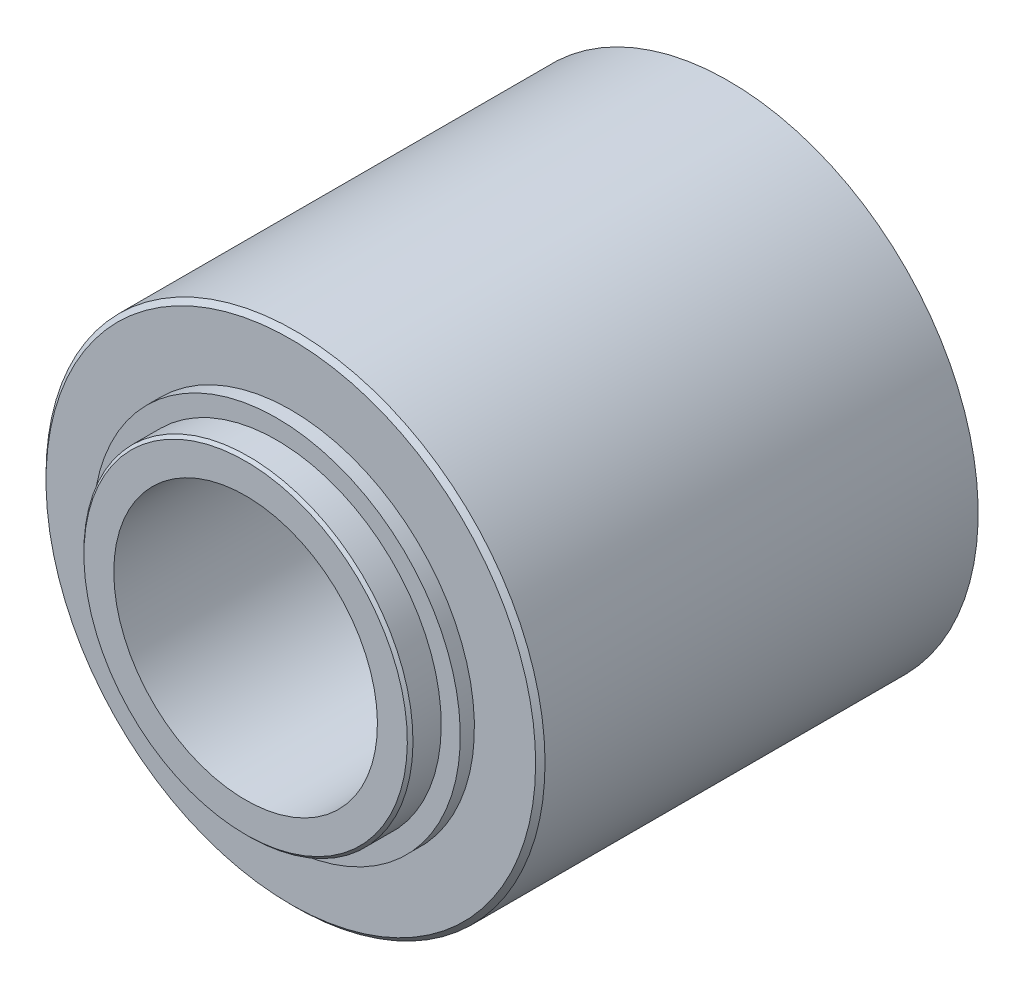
ISO-10303-21;
HEADER;
FILE_DESCRIPTION(('STEP AP214'),'2;1');
FILE_NAME('part.step','',(''),(''),'','','');
FILE_SCHEMA(('AUTOMOTIVE_DESIGN { 1 0 10303 214 1 1 1 1 }'));
ENDSEC;
DATA;
#1=APPLICATION_CONTEXT('core data for automotive mechanical design processes');
#2=APPLICATION_PROTOCOL_DEFINITION('international standard','automotive_design',2000,#1);
#3=PRODUCT_CONTEXT('',#1,'mechanical');
#4=PRODUCT('Part','Part','',(#3));
#5=PRODUCT_RELATED_PRODUCT_CATEGORY('part','',(#4));
#6=PRODUCT_DEFINITION_FORMATION('','',#4);
#7=PRODUCT_DEFINITION_CONTEXT('part definition',#1,'design');
#8=PRODUCT_DEFINITION('design','',#6,#7);
#9=PRODUCT_DEFINITION_SHAPE('','',#8);
#10=(LENGTH_UNIT() NAMED_UNIT(*) SI_UNIT(.MILLI.,.METRE.));
#11=(NAMED_UNIT(*) PLANE_ANGLE_UNIT() SI_UNIT($,.RADIAN.));
#12=(NAMED_UNIT(*) SI_UNIT($,.STERADIAN.) SOLID_ANGLE_UNIT());
#13=UNCERTAINTY_MEASURE_WITH_UNIT(LENGTH_MEASURE(1.E-05),#10,'distance_accuracy_value','');
#14=(GEOMETRIC_REPRESENTATION_CONTEXT(3) GLOBAL_UNCERTAINTY_ASSIGNED_CONTEXT((#13)) GLOBAL_UNIT_ASSIGNED_CONTEXT((#10,
#11,#12)) REPRESENTATION_CONTEXT('',''));
#15=CARTESIAN_POINT('',(0.,0.,0.));
#16=DIRECTION('',(0.,0.,1.));
#17=DIRECTION('',(1.,0.,0.));
#18=AXIS2_PLACEMENT_3D('',#15,#16,#17);
#19=CARTESIAN_POINT('',(0.,0.,46.5));
#20=DIRECTION('',(0.,0.,-1.));
#21=DIRECTION('',(-0.707106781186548,0.707106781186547,0.));
#22=AXIS2_PLACEMENT_3D('',#19,#20,#21);
#23=CONICAL_SURFACE('',#22,26.,0.785398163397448);
#24=CARTESIAN_POINT('',(0.,0.,46.5));
#25=DIRECTION('',(0.,0.,-1.));
#26=DIRECTION('',(-0.707106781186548,0.707106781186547,0.));
#27=AXIS2_PLACEMENT_3D('',#24,#25,#26);
#28=CIRCLE('',#27,26.);
#29=CARTESIAN_POINT('',(-18.3847763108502,18.3847763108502,46.5));
#30=VERTEX_POINT('',#29);
#31=EDGE_CURVE('E8',#30,#30,#28,.T.);
#32=ORIENTED_EDGE('',*,*,#31,.T.);
#33=EDGE_LOOP('',(#32));
#34=FACE_BOUND('',#33,.T.);
#35=CARTESIAN_POINT('',(0.,0.,46.));
#36=DIRECTION('',(0.,0.,-1.));
#37=DIRECTION('',(-1.,0.,0.));
#38=AXIS2_PLACEMENT_3D('',#35,#36,#37);
#39=CIRCLE('',#38,26.5);
#40=CARTESIAN_POINT('',(-26.5,0.,46.));
#41=VERTEX_POINT('',#40);
#42=EDGE_CURVE('E76',#41,#41,#39,.T.);
#43=ORIENTED_EDGE('',*,*,#42,.F.);
#44=EDGE_LOOP('',(#43));
#45=FACE_BOUND('',#44,.T.);
#46=ADVANCED_FACE('F12',(#34,#45),#23,.T.);
#47=CARTESIAN_POINT('',(-19.0918830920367,-19.0918830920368,0.));
#48=DIRECTION('',(0.,0.,1.));
#49=DIRECTION('',(0.707106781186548,-0.707106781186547,0.));
#50=AXIS2_PLACEMENT_3D('',#47,#48,#49);
#51=PLANE('',#50);
#52=CARTESIAN_POINT('',(0.,0.,0.));
#53=DIRECTION('',(0.,0.,-1.));
#54=DIRECTION('',(-0.707106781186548,0.707106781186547,0.));
#55=AXIS2_PLACEMENT_3D('',#52,#53,#54);
#56=CIRCLE('',#55,14.);
#57=CARTESIAN_POINT('',(-9.89949493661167,9.89949493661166,0.));
#58=VERTEX_POINT('',#57);
#59=EDGE_CURVE('E37',#58,#58,#56,.T.);
#60=ORIENTED_EDGE('',*,*,#59,.F.);
#61=EDGE_LOOP('',(#60));
#62=FACE_BOUND('',#61,.T.);
#63=CARTESIAN_POINT('',(-23.000259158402,-0.000447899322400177,0.));
#64=DIRECTION('',(0.,0.,-1.));
#65=DIRECTION('',(-0.707106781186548,0.707106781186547,0.));
#66=AXIS2_PLACEMENT_3D('',#63,#64,#65);
#67=CIRCLE('',#66,3.);
#68=CARTESIAN_POINT('',(-25.1215795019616,2.12087244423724,0.));
#69=VERTEX_POINT('',#68);
#70=EDGE_CURVE('E43',#69,#69,#67,.T.);
#71=ORIENTED_EDGE('',*,*,#70,.F.);
#72=EDGE_LOOP('',(#71));
#73=FACE_BOUND('',#72,.T.);
#74=CARTESIAN_POINT('',(11.499740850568,-19.919032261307,0.));
#75=DIRECTION('',(0.,0.,-1.));
#76=DIRECTION('',(-0.707106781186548,0.707106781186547,0.));
#77=AXIS2_PLACEMENT_3D('',#74,#75,#76);
#78=CIRCLE('',#77,3.);
#79=CARTESIAN_POINT('',(9.37842050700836,-17.7977119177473,0.));
#80=VERTEX_POINT('',#79);
#81=EDGE_CURVE('E49',#80,#80,#78,.T.);
#82=ORIENTED_EDGE('',*,*,#81,.F.);
#83=EDGE_LOOP('',(#82));
#84=FACE_BOUND('',#83,.T.);
#85=CARTESIAN_POINT('',(-11.5002591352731,-19.9190322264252,0.));
#86=DIRECTION('',(0.,0.,-1.));
#87=DIRECTION('',(-0.707106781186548,0.707106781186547,0.));
#88=AXIS2_PLACEMENT_3D('',#85,#86,#87);
#89=CIRCLE('',#88,3.);
#90=CARTESIAN_POINT('',(-13.6215794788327,-17.7977118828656,0.));
#91=VERTEX_POINT('',#90);
#92=EDGE_CURVE('E55',#91,#91,#89,.T.);
#93=ORIENTED_EDGE('',*,*,#92,.F.);
#94=EDGE_LOOP('',(#93));
#95=FACE_BOUND('',#94,.T.);
#96=CARTESIAN_POINT('',(-11.5002591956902,19.9181363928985,0.));
#97=DIRECTION('',(0.,0.,-1.));
#98=DIRECTION('',(-0.707106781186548,0.707106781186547,0.));
#99=AXIS2_PLACEMENT_3D('',#96,#97,#98);
#100=CIRCLE('',#99,3.);
#101=CARTESIAN_POINT('',(-13.6215795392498,22.0394567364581,0.));
#102=VERTEX_POINT('',#101);
#103=EDGE_CURVE('E61',#102,#102,#100,.T.);
#104=ORIENTED_EDGE('',*,*,#103,.F.);
#105=EDGE_LOOP('',(#104));
#106=FACE_BOUND('',#105,.T.);
#107=CARTESIAN_POINT('',(11.4997407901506,19.9181363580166,0.));
#108=DIRECTION('',(0.,0.,-1.));
#109=DIRECTION('',(-0.707106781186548,0.707106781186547,0.));
#110=AXIS2_PLACEMENT_3D('',#107,#108,#109);
#111=CIRCLE('',#110,3.);
#112=CARTESIAN_POINT('',(9.37842044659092,22.0394567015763,0.));
#113=VERTEX_POINT('',#112);
#114=EDGE_CURVE('E67',#113,#113,#111,.T.);
#115=ORIENTED_EDGE('',*,*,#114,.F.);
#116=EDGE_LOOP('',(#115));
#117=FACE_BOUND('',#116,.T.);
#118=CARTESIAN_POINT('',(22.9997408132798,-0.000447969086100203,0.));
#119=DIRECTION('',(0.,0.,-1.));
#120=DIRECTION('',(-0.707106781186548,0.707106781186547,0.));
#121=AXIS2_PLACEMENT_3D('',#118,#119,#120);
#122=CIRCLE('',#121,3.);
#123=CARTESIAN_POINT('',(20.8784204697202,2.12087237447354,0.));
#124=VERTEX_POINT('',#123);
#125=EDGE_CURVE('E73',#124,#124,#122,.T.);
#126=ORIENTED_EDGE('',*,*,#125,.F.);
#127=EDGE_LOOP('',(#126));
#128=FACE_BOUND('',#127,.T.);
#129=CARTESIAN_POINT('',(0.,0.,0.));
#130=DIRECTION('',(0.,0.,-1.));
#131=DIRECTION('',(-1.,0.,0.));
#132=AXIS2_PLACEMENT_3D('',#129,#130,#131);
#133=CIRCLE('',#132,26.5);
#134=CARTESIAN_POINT('',(-26.5,0.,0.));
#135=VERTEX_POINT('',#134);
#136=EDGE_CURVE('E79',#135,#135,#133,.T.);
#137=ORIENTED_EDGE('',*,*,#136,.T.);
#138=EDGE_LOOP('',(#137));
#139=FACE_BOUND('',#138,.T.);
#140=ADVANCED_FACE('F107',(#62,#73,#84,#95,#106,#117,#128,#139),#51,.F.);
#141=CARTESIAN_POINT('',(-18.3847763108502,-18.3847763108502,46.5));
#142=DIRECTION('',(0.,0.,-1.));
#143=DIRECTION('',(-0.707106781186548,0.707106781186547,0.));
#144=AXIS2_PLACEMENT_3D('',#141,#142,#143);
#145=PLANE('',#144);
#146=ORIENTED_EDGE('',*,*,#31,.F.);
#147=EDGE_LOOP('',(#146));
#148=FACE_BOUND('',#147,.T.);
#149=CARTESIAN_POINT('',(0.,0.,46.5));
#150=DIRECTION('',(0.,0.,-1.));
#151=DIRECTION('',(-0.707106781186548,0.707106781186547,0.));
#152=AXIS2_PLACEMENT_3D('',#149,#150,#151);
#153=CIRCLE('',#152,19.5);
#154=CARTESIAN_POINT('',(-13.7885822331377,13.7885822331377,46.5));
#155=VERTEX_POINT('',#154);
#156=EDGE_CURVE('E18',#155,#155,#153,.T.);
#157=ORIENTED_EDGE('',*,*,#156,.T.);
#158=EDGE_LOOP('',(#157));
#159=FACE_BOUND('',#158,.T.);
#160=ADVANCED_FACE('F112',(#148,#159),#145,.F.);
#161=CARTESIAN_POINT('',(0.,0.,-5.));
#162=DIRECTION('',(0.,0.,-1.));
#163=DIRECTION('',(-0.707106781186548,0.707106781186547,0.));
#164=AXIS2_PLACEMENT_3D('',#161,#162,#163);
#165=CYLINDRICAL_SURFACE('',#164,19.5);
#166=ORIENTED_EDGE('',*,*,#156,.F.);
#167=EDGE_LOOP('',(#166));
#168=FACE_BOUND('',#167,.T.);
#169=CARTESIAN_POINT('',(0.,0.,48.));
#170=DIRECTION('',(0.,0.,-1.));
#171=DIRECTION('',(-0.707106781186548,0.707106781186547,0.));
#172=AXIS2_PLACEMENT_3D('',#169,#170,#171);
#173=CIRCLE('',#172,19.5);
#174=CARTESIAN_POINT('',(-13.7885822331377,13.7885822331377,48.));
#175=VERTEX_POINT('',#174);
#176=EDGE_CURVE('E22',#175,#175,#173,.T.);
#177=ORIENTED_EDGE('',*,*,#176,.T.);
#178=EDGE_LOOP('',(#177));
#179=FACE_BOUND('',#178,.T.);
#180=ADVANCED_FACE('F313',(#168,#179),#165,.T.);
#181=CARTESIAN_POINT('',(-13.7885822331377,-13.7885822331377,48.));
#182=DIRECTION('',(0.,0.,-1.));
#183=DIRECTION('',(-0.707106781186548,0.707106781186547,0.));
#184=AXIS2_PLACEMENT_3D('',#181,#182,#183);
#185=PLANE('',#184);
#186=ORIENTED_EDGE('',*,*,#176,.F.);
#187=EDGE_LOOP('',(#186));
#188=FACE_BOUND('',#187,.T.);
#189=CARTESIAN_POINT('',(0.,0.,48.));
#190=DIRECTION('',(0.,0.,-1.));
#191=DIRECTION('',(-0.707106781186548,0.707106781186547,0.));
#192=AXIS2_PLACEMENT_3D('',#189,#190,#191);
#193=CIRCLE('',#192,17.475);
#194=CARTESIAN_POINT('',(-12.3566910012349,12.3566910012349,48.));
#195=VERTEX_POINT('',#194);
#196=EDGE_CURVE('E26',#195,#195,#193,.T.);
#197=ORIENTED_EDGE('',*,*,#196,.T.);
#198=EDGE_LOOP('',(#197));
#199=FACE_BOUND('',#198,.T.);
#200=ADVANCED_FACE('F304',(#188,#199),#185,.F.);
#201=CARTESIAN_POINT('',(0.,0.,-5.));
#202=DIRECTION('',(0.,0.,-1.));
#203=DIRECTION('',(-0.707106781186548,0.707106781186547,0.));
#204=AXIS2_PLACEMENT_3D('',#201,#202,#203);
#205=CYLINDRICAL_SURFACE('',#204,17.475);
#206=ORIENTED_EDGE('',*,*,#196,.F.);
#207=EDGE_LOOP('',(#206));
#208=FACE_BOUND('',#207,.T.);
#209=CARTESIAN_POINT('',(0.,0.,51.));
#210=DIRECTION('',(0.,0.,-1.));
#211=DIRECTION('',(-0.707106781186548,0.707106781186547,0.));
#212=AXIS2_PLACEMENT_3D('',#209,#210,#211);
#213=CIRCLE('',#212,17.475);
#214=CARTESIAN_POINT('',(-12.3566910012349,12.3566910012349,51.));
#215=VERTEX_POINT('',#214);
#216=EDGE_CURVE('E31',#215,#215,#213,.T.);
#217=ORIENTED_EDGE('',*,*,#216,.T.);
#218=EDGE_LOOP('',(#217));
#219=FACE_BOUND('',#218,.T.);
#220=ADVANCED_FACE('F296',(#208,#219),#205,.T.);
#221=CARTESIAN_POINT('',(0.,0.,51.3));
#222=DIRECTION('',(0.,0.,-1.));
#223=DIRECTION('',(-0.707106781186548,0.707106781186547,0.));
#224=AXIS2_PLACEMENT_3D('',#221,#222,#223);
#225=CONICAL_SURFACE('',#224,17.175,0.785398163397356);
#226=ORIENTED_EDGE('',*,*,#216,.F.);
#227=EDGE_LOOP('',(#226));
#228=FACE_BOUND('',#227,.T.);
#229=CARTESIAN_POINT('',(0.,0.,51.3));
#230=DIRECTION('',(0.,0.,-1.));
#231=DIRECTION('',(-0.707106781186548,0.707106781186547,0.));
#232=AXIS2_PLACEMENT_3D('',#229,#230,#231);
#233=CIRCLE('',#232,17.175);
#234=CARTESIAN_POINT('',(-12.144558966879,12.1445589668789,51.3));
#235=VERTEX_POINT('',#234);
#236=EDGE_CURVE('E34',#235,#235,#233,.T.);
#237=ORIENTED_EDGE('',*,*,#236,.T.);
#238=EDGE_LOOP('',(#237));
#239=FACE_BOUND('',#238,.T.);
#240=ADVANCED_FACE('F102',(#228,#239),#225,.T.);
#241=CARTESIAN_POINT('',(-12.144558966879,-12.1445589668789,51.3));
#242=DIRECTION('',(0.,0.,-1.));
#243=DIRECTION('',(-0.707106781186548,0.707106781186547,0.));
#244=AXIS2_PLACEMENT_3D('',#241,#242,#243);
#245=PLANE('',#244);
#246=ORIENTED_EDGE('',*,*,#236,.F.);
#247=EDGE_LOOP('',(#246));
#248=FACE_BOUND('',#247,.T.);
#249=CARTESIAN_POINT('',(0.,0.,51.3));
#250=DIRECTION('',(0.,0.,-1.));
#251=DIRECTION('',(-1.,0.,0.));
#252=AXIS2_PLACEMENT_3D('',#249,#250,#251);
#253=CIRCLE('',#252,14.);
#254=CARTESIAN_POINT('',(-14.,0.,51.3));
#255=VERTEX_POINT('',#254);
#256=EDGE_CURVE('E82',#255,#255,#253,.T.);
#257=ORIENTED_EDGE('',*,*,#256,.T.);
#258=EDGE_LOOP('',(#257));
#259=FACE_BOUND('',#258,.T.);
#260=ADVANCED_FACE('F86',(#248,#259),#245,.F.);
#261=CARTESIAN_POINT('',(0.,0.,-5.));
#262=DIRECTION('',(0.,0.,-1.));
#263=DIRECTION('',(-0.707106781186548,0.707106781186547,0.));
#264=AXIS2_PLACEMENT_3D('',#261,#262,#263);
#265=CYLINDRICAL_SURFACE('',#264,14.);
#266=ORIENTED_EDGE('',*,*,#59,.T.);
#267=EDGE_LOOP('',(#266));
#268=FACE_BOUND('',#267,.T.);
#269=ORIENTED_EDGE('',*,*,#256,.F.);
#270=EDGE_LOOP('',(#269));
#271=FACE_BOUND('',#270,.T.);
#272=ADVANCED_FACE('F88',(#268,#271),#265,.F.);
#273=CARTESIAN_POINT('',(-23.000259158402,-0.000447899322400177,9.));
#274=DIRECTION('',(0.,0.,-1.));
#275=DIRECTION('',(-0.707106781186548,0.707106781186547,0.));
#276=AXIS2_PLACEMENT_3D('',#273,#274,#275);
#277=CYLINDRICAL_SURFACE('',#276,3.);
#278=CARTESIAN_POINT('',(-23.000259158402,-0.000447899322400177,9.));
#279=DIRECTION('',(0.,0.,-1.));
#280=DIRECTION('',(-0.707106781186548,0.707106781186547,0.));
#281=AXIS2_PLACEMENT_3D('',#278,#279,#280);
#282=CIRCLE('',#281,3.);
#283=CARTESIAN_POINT('',(-25.1215795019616,2.12087244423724,9.));
#284=VERTEX_POINT('',#283);
#285=EDGE_CURVE('E40',#284,#284,#282,.T.);
#286=ORIENTED_EDGE('',*,*,#285,.F.);
#287=EDGE_LOOP('',(#286));
#288=FACE_BOUND('',#287,.T.);
#289=ORIENTED_EDGE('',*,*,#70,.T.);
#290=EDGE_LOOP('',(#289));
#291=FACE_BOUND('',#290,.T.);
#292=ADVANCED_FACE('F90',(#288,#291),#277,.F.);
#293=CARTESIAN_POINT('',(-23.000259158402,-0.000447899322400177,9.));
#294=DIRECTION('',(0.,0.,-1.));
#295=DIRECTION('',(-0.707106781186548,0.707106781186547,0.));
#296=AXIS2_PLACEMENT_3D('',#293,#294,#295);
#297=PLANE('',#296);
#298=ORIENTED_EDGE('',*,*,#285,.T.);
#299=EDGE_LOOP('',(#298));
#300=FACE_BOUND('',#299,.T.);
#301=ADVANCED_FACE('F99',(#300),#297,.T.);
#302=CARTESIAN_POINT('',(11.499740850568,-19.919032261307,9.));
#303=DIRECTION('',(0.,0.,-1.));
#304=DIRECTION('',(-0.707106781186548,0.707106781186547,0.));
#305=AXIS2_PLACEMENT_3D('',#302,#303,#304);
#306=CYLINDRICAL_SURFACE('',#305,3.);
#307=CARTESIAN_POINT('',(11.499740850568,-19.919032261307,9.));
#308=DIRECTION('',(0.,0.,-1.));
#309=DIRECTION('',(-0.707106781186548,0.707106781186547,0.));
#310=AXIS2_PLACEMENT_3D('',#307,#308,#309);
#311=CIRCLE('',#310,3.);
#312=CARTESIAN_POINT('',(9.37842050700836,-17.7977119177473,9.));
#313=VERTEX_POINT('',#312);
#314=EDGE_CURVE('E46',#313,#313,#311,.T.);
#315=ORIENTED_EDGE('',*,*,#314,.F.);
#316=EDGE_LOOP('',(#315));
#317=FACE_BOUND('',#316,.T.);
#318=ORIENTED_EDGE('',*,*,#81,.T.);
#319=EDGE_LOOP('',(#318));
#320=FACE_BOUND('',#319,.T.);
#321=ADVANCED_FACE('F161',(#317,#320),#306,.F.);
#322=CARTESIAN_POINT('',(11.499740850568,-19.919032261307,9.));
#323=DIRECTION('',(0.,0.,-1.));
#324=DIRECTION('',(-0.707106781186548,0.707106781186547,0.));
#325=AXIS2_PLACEMENT_3D('',#322,#323,#324);
#326=PLANE('',#325);
#327=ORIENTED_EDGE('',*,*,#314,.T.);
#328=EDGE_LOOP('',(#327));
#329=FACE_BOUND('',#328,.T.);
#330=ADVANCED_FACE('F157',(#329),#326,.T.);
#331=CARTESIAN_POINT('',(-11.5002591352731,-19.9190322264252,9.));
#332=DIRECTION('',(0.,0.,-1.));
#333=DIRECTION('',(-0.707106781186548,0.707106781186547,0.));
#334=AXIS2_PLACEMENT_3D('',#331,#332,#333);
#335=CYLINDRICAL_SURFACE('',#334,3.);
#336=CARTESIAN_POINT('',(-11.5002591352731,-19.9190322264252,9.));
#337=DIRECTION('',(0.,0.,-1.));
#338=DIRECTION('',(-0.707106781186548,0.707106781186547,0.));
#339=AXIS2_PLACEMENT_3D('',#336,#337,#338);
#340=CIRCLE('',#339,3.);
#341=CARTESIAN_POINT('',(-13.6215794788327,-17.7977118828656,9.));
#342=VERTEX_POINT('',#341);
#343=EDGE_CURVE('E52',#342,#342,#340,.T.);
#344=ORIENTED_EDGE('',*,*,#343,.F.);
#345=EDGE_LOOP('',(#344));
#346=FACE_BOUND('',#345,.T.);
#347=ORIENTED_EDGE('',*,*,#92,.T.);
#348=EDGE_LOOP('',(#347));
#349=FACE_BOUND('',#348,.T.);
#350=ADVANCED_FACE('F153',(#346,#349),#335,.F.);
#351=CARTESIAN_POINT('',(-11.5002591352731,-19.9190322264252,9.));
#352=DIRECTION('',(0.,0.,-1.));
#353=DIRECTION('',(-0.707106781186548,0.707106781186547,0.));
#354=AXIS2_PLACEMENT_3D('',#351,#352,#353);
#355=PLANE('',#354);
#356=ORIENTED_EDGE('',*,*,#343,.T.);
#357=EDGE_LOOP('',(#356));
#358=FACE_BOUND('',#357,.T.);
#359=ADVANCED_FACE('F149',(#358),#355,.T.);
#360=CARTESIAN_POINT('',(-11.5002591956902,19.9181363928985,9.));
#361=DIRECTION('',(0.,0.,-1.));
#362=DIRECTION('',(-0.707106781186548,0.707106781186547,0.));
#363=AXIS2_PLACEMENT_3D('',#360,#361,#362);
#364=CYLINDRICAL_SURFACE('',#363,3.);
#365=CARTESIAN_POINT('',(-11.5002591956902,19.9181363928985,9.));
#366=DIRECTION('',(0.,0.,-1.));
#367=DIRECTION('',(-0.707106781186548,0.707106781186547,0.));
#368=AXIS2_PLACEMENT_3D('',#365,#366,#367);
#369=CIRCLE('',#368,3.);
#370=CARTESIAN_POINT('',(-13.6215795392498,22.0394567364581,9.));
#371=VERTEX_POINT('',#370);
#372=EDGE_CURVE('E58',#371,#371,#369,.T.);
#373=ORIENTED_EDGE('',*,*,#372,.F.);
#374=EDGE_LOOP('',(#373));
#375=FACE_BOUND('',#374,.T.);
#376=ORIENTED_EDGE('',*,*,#103,.T.);
#377=EDGE_LOOP('',(#376));
#378=FACE_BOUND('',#377,.T.);
#379=ADVANCED_FACE('F145',(#375,#378),#364,.F.);
#380=CARTESIAN_POINT('',(-11.5002591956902,19.9181363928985,9.));
#381=DIRECTION('',(0.,0.,-1.));
#382=DIRECTION('',(-0.707106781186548,0.707106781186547,0.));
#383=AXIS2_PLACEMENT_3D('',#380,#381,#382);
#384=PLANE('',#383);
#385=ORIENTED_EDGE('',*,*,#372,.T.);
#386=EDGE_LOOP('',(#385));
#387=FACE_BOUND('',#386,.T.);
#388=ADVANCED_FACE('F141',(#387),#384,.T.);
#389=CARTESIAN_POINT('',(11.4997407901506,19.9181363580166,9.));
#390=DIRECTION('',(0.,0.,-1.));
#391=DIRECTION('',(-0.707106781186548,0.707106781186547,0.));
#392=AXIS2_PLACEMENT_3D('',#389,#390,#391);
#393=CYLINDRICAL_SURFACE('',#392,3.);
#394=CARTESIAN_POINT('',(11.4997407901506,19.9181363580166,9.));
#395=DIRECTION('',(0.,0.,-1.));
#396=DIRECTION('',(-0.707106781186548,0.707106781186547,0.));
#397=AXIS2_PLACEMENT_3D('',#394,#395,#396);
#398=CIRCLE('',#397,3.);
#399=CARTESIAN_POINT('',(9.37842044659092,22.0394567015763,9.));
#400=VERTEX_POINT('',#399);
#401=EDGE_CURVE('E64',#400,#400,#398,.T.);
#402=ORIENTED_EDGE('',*,*,#401,.F.);
#403=EDGE_LOOP('',(#402));
#404=FACE_BOUND('',#403,.T.);
#405=ORIENTED_EDGE('',*,*,#114,.T.);
#406=EDGE_LOOP('',(#405));
#407=FACE_BOUND('',#406,.T.);
#408=ADVANCED_FACE('F137',(#404,#407),#393,.F.);
#409=CARTESIAN_POINT('',(11.4997407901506,19.9181363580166,9.));
#410=DIRECTION('',(0.,0.,-1.));
#411=DIRECTION('',(-0.707106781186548,0.707106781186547,0.));
#412=AXIS2_PLACEMENT_3D('',#409,#410,#411);
#413=PLANE('',#412);
#414=ORIENTED_EDGE('',*,*,#401,.T.);
#415=EDGE_LOOP('',(#414));
#416=FACE_BOUND('',#415,.T.);
#417=ADVANCED_FACE('F133',(#416),#413,.T.);
#418=CARTESIAN_POINT('',(22.9997408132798,-0.000447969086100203,9.));
#419=DIRECTION('',(0.,0.,-1.));
#420=DIRECTION('',(-0.707106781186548,0.707106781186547,0.));
#421=AXIS2_PLACEMENT_3D('',#418,#419,#420);
#422=CYLINDRICAL_SURFACE('',#421,3.);
#423=CARTESIAN_POINT('',(22.9997408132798,-0.000447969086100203,9.));
#424=DIRECTION('',(0.,0.,-1.));
#425=DIRECTION('',(-0.707106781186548,0.707106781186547,0.));
#426=AXIS2_PLACEMENT_3D('',#423,#424,#425);
#427=CIRCLE('',#426,3.);
#428=CARTESIAN_POINT('',(20.8784204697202,2.12087237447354,9.));
#429=VERTEX_POINT('',#428);
#430=EDGE_CURVE('E70',#429,#429,#427,.T.);
#431=ORIENTED_EDGE('',*,*,#430,.F.);
#432=EDGE_LOOP('',(#431));
#433=FACE_BOUND('',#432,.T.);
#434=ORIENTED_EDGE('',*,*,#125,.T.);
#435=EDGE_LOOP('',(#434));
#436=FACE_BOUND('',#435,.T.);
#437=ADVANCED_FACE('F126',(#433,#436),#422,.F.);
#438=CARTESIAN_POINT('',(22.9997408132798,-0.000447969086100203,9.));
#439=DIRECTION('',(0.,0.,-1.));
#440=DIRECTION('',(-0.707106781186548,0.707106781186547,0.));
#441=AXIS2_PLACEMENT_3D('',#438,#439,#440);
#442=PLANE('',#441);
#443=ORIENTED_EDGE('',*,*,#430,.T.);
#444=EDGE_LOOP('',(#443));
#445=FACE_BOUND('',#444,.T.);
#446=ADVANCED_FACE('F119',(#445),#442,.T.);
#447=CARTESIAN_POINT('',(0.,0.,66.5));
#448=DIRECTION('',(0.,0.,-1.));
#449=DIRECTION('',(-1.,0.,0.));
#450=AXIS2_PLACEMENT_3D('',#447,#448,#449);
#451=CYLINDRICAL_SURFACE('',#450,26.5);
#452=ORIENTED_EDGE('',*,*,#136,.F.);
#453=EDGE_LOOP('',(#452));
#454=FACE_BOUND('',#453,.T.);
#455=ORIENTED_EDGE('',*,*,#42,.T.);
#456=EDGE_LOOP('',(#455));
#457=FACE_BOUND('',#456,.T.);
#458=ADVANCED_FACE('F117',(#454,#457),#451,.T.);
#459=CLOSED_SHELL('',(#46,#140,#160,#180,#200,#220,#240,#260,#272,#292,#301,#321,#330,#350,#359,
#379,#388,#408,#417,#437,#446,#458));
#460=MANIFOLD_SOLID_BREP('B1',#459);
#461=ADVANCED_BREP_SHAPE_REPRESENTATION('',(#18,#460),#14);
#462=SHAPE_DEFINITION_REPRESENTATION(#9,#461);
ENDSEC;
END-ISO-10303-21;
